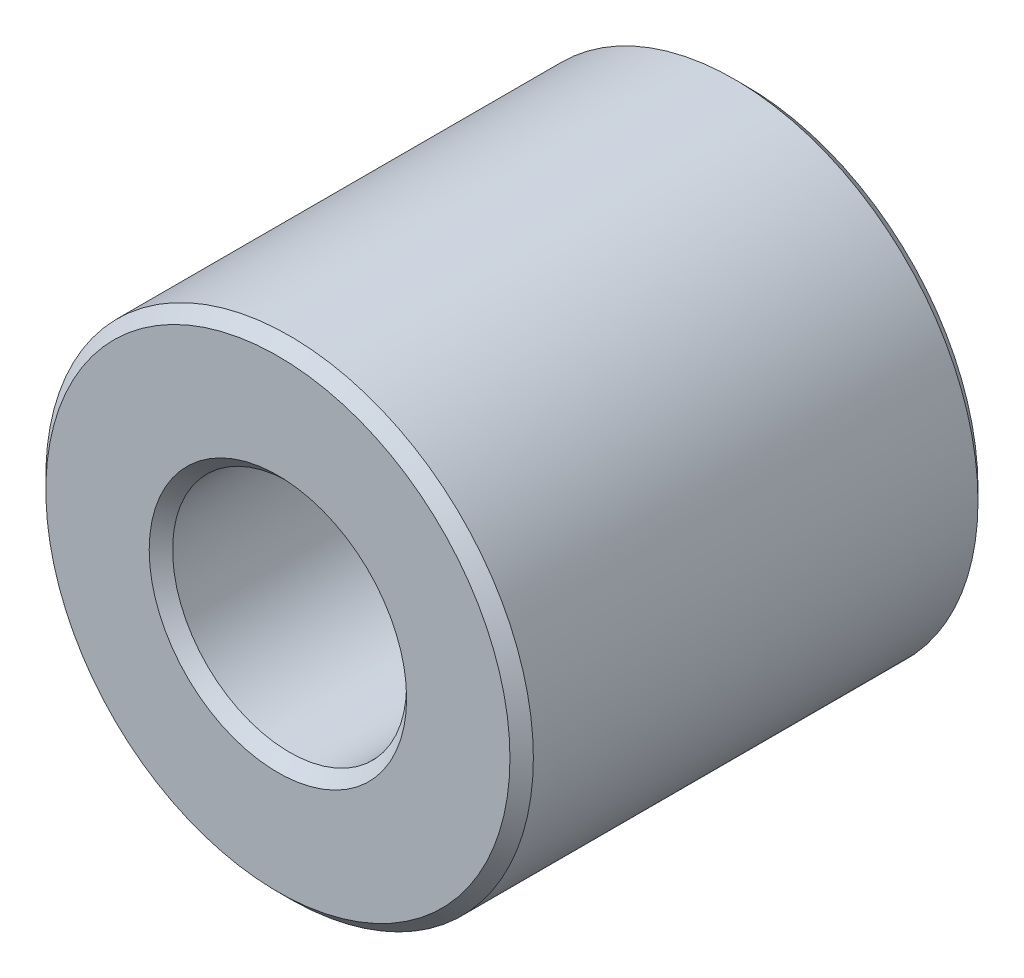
ISO-10303-21;
HEADER;
FILE_DESCRIPTION(('STEP AP214'),'2;1');
FILE_NAME('part.step','',(''),(''),'','','');
FILE_SCHEMA(('AUTOMOTIVE_DESIGN { 1 0 10303 214 1 1 1 1 }'));
ENDSEC;
DATA;
#1=APPLICATION_CONTEXT('core data for automotive mechanical design processes');
#2=APPLICATION_PROTOCOL_DEFINITION('international standard','automotive_design',2000,#1);
#3=PRODUCT_CONTEXT('',#1,'mechanical');
#4=PRODUCT('Part','Part','',(#3));
#5=PRODUCT_RELATED_PRODUCT_CATEGORY('part','',(#4));
#6=PRODUCT_DEFINITION_FORMATION('','',#4);
#7=PRODUCT_DEFINITION_CONTEXT('part definition',#1,'design');
#8=PRODUCT_DEFINITION('design','',#6,#7);
#9=PRODUCT_DEFINITION_SHAPE('','',#8);
#10=(LENGTH_UNIT() NAMED_UNIT(*) SI_UNIT(.MILLI.,.METRE.));
#11=(NAMED_UNIT(*) PLANE_ANGLE_UNIT() SI_UNIT($,.RADIAN.));
#12=(NAMED_UNIT(*) SI_UNIT($,.STERADIAN.) SOLID_ANGLE_UNIT());
#13=UNCERTAINTY_MEASURE_WITH_UNIT(LENGTH_MEASURE(1.E-05),#10,'distance_accuracy_value','');
#14=(GEOMETRIC_REPRESENTATION_CONTEXT(3) GLOBAL_UNCERTAINTY_ASSIGNED_CONTEXT((#13)) GLOBAL_UNIT_ASSIGNED_CONTEXT((#10,
#11,#12)) REPRESENTATION_CONTEXT('',''));
#15=CARTESIAN_POINT('',(0.,0.,0.));
#16=DIRECTION('',(0.,0.,1.));
#17=DIRECTION('',(1.,0.,0.));
#18=AXIS2_PLACEMENT_3D('',#15,#16,#17);
#19=CARTESIAN_POINT('',(0.,0.,24.));
#20=DIRECTION('',(0.,0.,1.));
#21=DIRECTION('',(1.,0.,0.));
#22=AXIS2_PLACEMENT_3D('',#19,#20,#21);
#23=PLANE('',#22);
#24=CARTESIAN_POINT('',(0.,0.,24.));
#25=DIRECTION('',(0.,0.,1.));
#26=DIRECTION('',(1.,0.,0.));
#27=AXIS2_PLACEMENT_3D('',#24,#25,#26);
#28=CIRCLE('',#27,13.2);
#29=CARTESIAN_POINT('',(13.2,0.,24.));
#30=VERTEX_POINT('',#29);
#31=EDGE_CURVE('E10',#30,#30,#28,.F.);
#32=ORIENTED_EDGE('',*,*,#31,.T.);
#33=EDGE_LOOP('',(#32));
#34=FACE_BOUND('',#33,.T.);
#35=CARTESIAN_POINT('',(0.,0.,24.));
#36=DIRECTION('',(0.,0.,1.));
#37=DIRECTION('',(1.,0.,0.));
#38=AXIS2_PLACEMENT_3D('',#35,#36,#37);
#39=CIRCLE('',#38,23.8);
#40=CARTESIAN_POINT('',(23.8,0.,24.));
#41=VERTEX_POINT('',#40);
#42=EDGE_CURVE('E45',#41,#41,#39,.T.);
#43=ORIENTED_EDGE('',*,*,#42,.T.);
#44=EDGE_LOOP('',(#43));
#45=FACE_BOUND('',#44,.T.);
#46=ADVANCED_FACE('F37',(#34,#45),#23,.T.);
#47=CARTESIAN_POINT('',(0.,0.,-24.));
#48=DIRECTION('',(0.,0.,1.));
#49=DIRECTION('',(1.,0.,0.));
#50=AXIS2_PLACEMENT_3D('',#47,#48,#49);
#51=PLANE('',#50);
#52=CARTESIAN_POINT('',(0.,0.,-24.));
#53=DIRECTION('',(0.,0.,1.));
#54=DIRECTION('',(1.,0.,0.));
#55=AXIS2_PLACEMENT_3D('',#52,#53,#54);
#56=CIRCLE('',#55,13.2);
#57=CARTESIAN_POINT('',(13.2,0.,-24.));
#58=VERTEX_POINT('',#57);
#59=EDGE_CURVE('E70',#58,#58,#56,.T.);
#60=ORIENTED_EDGE('',*,*,#59,.T.);
#61=EDGE_LOOP('',(#60));
#62=FACE_BOUND('',#61,.T.);
#63=CARTESIAN_POINT('',(0.,0.,-24.));
#64=DIRECTION('',(0.,0.,1.));
#65=DIRECTION('',(1.,0.,0.));
#66=AXIS2_PLACEMENT_3D('',#63,#64,#65);
#67=CIRCLE('',#66,23.8);
#68=CARTESIAN_POINT('',(23.8,0.,-24.));
#69=VERTEX_POINT('',#68);
#70=EDGE_CURVE('E74',#69,#69,#67,.F.);
#71=ORIENTED_EDGE('',*,*,#70,.T.);
#72=EDGE_LOOP('',(#71));
#73=FACE_BOUND('',#72,.T.);
#74=ADVANCED_FACE('F78',(#62,#73),#51,.F.);
#75=CARTESIAN_POINT('',(0.,0.,24.));
#76=DIRECTION('',(0.,0.,-1.));
#77=DIRECTION('',(-1.,0.,0.));
#78=AXIS2_PLACEMENT_3D('',#75,#76,#77);
#79=CYLINDRICAL_SURFACE('',#78,25.);
#80=CARTESIAN_POINT('',(0.,0.,-22.8));
#81=DIRECTION('',(0.,0.,1.));
#82=DIRECTION('',(1.,0.,0.));
#83=AXIS2_PLACEMENT_3D('',#80,#81,#82);
#84=CIRCLE('',#83,25.);
#85=CARTESIAN_POINT('',(25.,0.,-22.8));
#86=VERTEX_POINT('',#85);
#87=EDGE_CURVE('E52',#86,#86,#84,.T.);
#88=ORIENTED_EDGE('',*,*,#87,.T.);
#89=EDGE_LOOP('',(#88));
#90=FACE_BOUND('',#89,.T.);
#91=CARTESIAN_POINT('',(0.,0.,22.8));
#92=DIRECTION('',(0.,0.,1.));
#93=DIRECTION('',(1.,0.,0.));
#94=AXIS2_PLACEMENT_3D('',#91,#92,#93);
#95=CIRCLE('',#94,25.);
#96=CARTESIAN_POINT('',(25.,0.,22.8));
#97=VERTEX_POINT('',#96);
#98=EDGE_CURVE('E57',#97,#97,#95,.F.);
#99=ORIENTED_EDGE('',*,*,#98,.T.);
#100=EDGE_LOOP('',(#99));
#101=FACE_BOUND('',#100,.T.);
#102=ADVANCED_FACE('F88',(#90,#101),#79,.T.);
#103=CARTESIAN_POINT('',(0.,0.,24.));
#104=DIRECTION('',(0.,0.,-1.));
#105=DIRECTION('',(-1.,0.,0.));
#106=AXIS2_PLACEMENT_3D('',#103,#104,#105);
#107=CYLINDRICAL_SURFACE('',#106,12.);
#108=CARTESIAN_POINT('',(0.,0.,-22.8));
#109=DIRECTION('',(0.,0.,1.));
#110=DIRECTION('',(1.,0.,0.));
#111=AXIS2_PLACEMENT_3D('',#108,#109,#110);
#112=CIRCLE('',#111,12.);
#113=CARTESIAN_POINT('',(12.,0.,-22.8));
#114=VERTEX_POINT('',#113);
#115=EDGE_CURVE('E62',#114,#114,#112,.F.);
#116=ORIENTED_EDGE('',*,*,#115,.T.);
#117=EDGE_LOOP('',(#116));
#118=FACE_BOUND('',#117,.T.);
#119=CARTESIAN_POINT('',(0.,0.,22.8));
#120=DIRECTION('',(0.,0.,1.));
#121=DIRECTION('',(1.,0.,0.));
#122=AXIS2_PLACEMENT_3D('',#119,#120,#121);
#123=CIRCLE('',#122,12.);
#124=CARTESIAN_POINT('',(12.,0.,22.8));
#125=VERTEX_POINT('',#124);
#126=EDGE_CURVE('E66',#125,#125,#123,.T.);
#127=ORIENTED_EDGE('',*,*,#126,.T.);
#128=EDGE_LOOP('',(#127));
#129=FACE_BOUND('',#128,.T.);
#130=ADVANCED_FACE('F91',(#118,#129),#107,.F.);
#131=CARTESIAN_POINT('',(0.,0.,-24.));
#132=DIRECTION('',(0.,0.,-1.));
#133=DIRECTION('',(-1.,0.,0.));
#134=AXIS2_PLACEMENT_3D('',#131,#132,#133);
#135=CONICAL_SURFACE('',#134,13.2,0.785398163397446);
#136=ORIENTED_EDGE('',*,*,#115,.F.);
#137=EDGE_LOOP('',(#136));
#138=FACE_BOUND('',#137,.T.);
#139=ORIENTED_EDGE('',*,*,#59,.F.);
#140=EDGE_LOOP('',(#139));
#141=FACE_BOUND('',#140,.T.);
#142=ADVANCED_FACE('F84',(#138,#141),#135,.F.);
#143=CARTESIAN_POINT('',(0.,0.,-22.8));
#144=DIRECTION('',(0.,0.,1.));
#145=DIRECTION('',(1.,0.,0.));
#146=AXIS2_PLACEMENT_3D('',#143,#144,#145);
#147=CONICAL_SURFACE('',#146,25.,0.785398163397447);
#148=ORIENTED_EDGE('',*,*,#70,.F.);
#149=EDGE_LOOP('',(#148));
#150=FACE_BOUND('',#149,.T.);
#151=ORIENTED_EDGE('',*,*,#87,.F.);
#152=EDGE_LOOP('',(#151));
#153=FACE_BOUND('',#152,.T.);
#154=ADVANCED_FACE('F80',(#150,#153),#147,.T.);
#155=CARTESIAN_POINT('',(0.,0.,22.8));
#156=DIRECTION('',(0.,0.,1.));
#157=DIRECTION('',(1.,0.,0.));
#158=AXIS2_PLACEMENT_3D('',#155,#156,#157);
#159=CONICAL_SURFACE('',#158,12.,0.785398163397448);
#160=ORIENTED_EDGE('',*,*,#31,.F.);
#161=EDGE_LOOP('',(#160));
#162=FACE_BOUND('',#161,.T.);
#163=ORIENTED_EDGE('',*,*,#126,.F.);
#164=EDGE_LOOP('',(#163));
#165=FACE_BOUND('',#164,.T.);
#166=ADVANCED_FACE('F83',(#162,#165),#159,.F.);
#167=CARTESIAN_POINT('',(0.,0.,24.));
#168=DIRECTION('',(0.,0.,-1.));
#169=DIRECTION('',(-1.,0.,0.));
#170=AXIS2_PLACEMENT_3D('',#167,#168,#169);
#171=CONICAL_SURFACE('',#170,23.8,0.78539816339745);
#172=ORIENTED_EDGE('',*,*,#98,.F.);
#173=EDGE_LOOP('',(#172));
#174=FACE_BOUND('',#173,.T.);
#175=ORIENTED_EDGE('',*,*,#42,.F.);
#176=EDGE_LOOP('',(#175));
#177=FACE_BOUND('',#176,.T.);
#178=ADVANCED_FACE('F39',(#174,#177),#171,.T.);
#179=CLOSED_SHELL('',(#46,#74,#102,#130,#142,#154,#166,#178));
#180=MANIFOLD_SOLID_BREP('B2',#179);
#181=ADVANCED_BREP_SHAPE_REPRESENTATION('',(#18,#180),#14);
#182=SHAPE_DEFINITION_REPRESENTATION(#9,#181);
ENDSEC;
END-ISO-10303-21;
